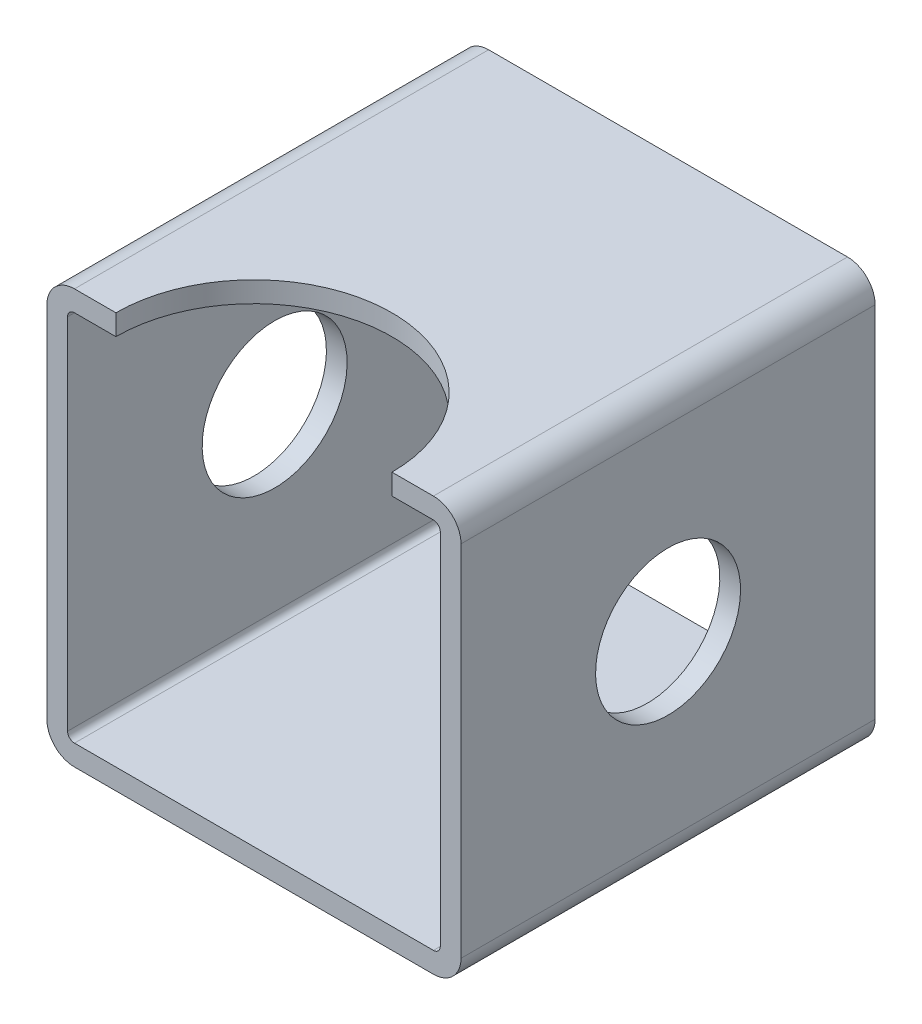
ISO-10303-21;
HEADER;
FILE_DESCRIPTION(('STEP AP214'),'2;1');
FILE_NAME('part.step','',(''),(''),'','','');
FILE_SCHEMA(('AUTOMOTIVE_DESIGN { 1 0 10303 214 1 1 1 1 }'));
ENDSEC;
DATA;
#1=APPLICATION_CONTEXT('core data for automotive mechanical design processes');
#2=APPLICATION_PROTOCOL_DEFINITION('international standard','automotive_design',2000,#1);
#3=PRODUCT_CONTEXT('',#1,'mechanical');
#4=PRODUCT('Part','Part','',(#3));
#5=PRODUCT_RELATED_PRODUCT_CATEGORY('part','',(#4));
#6=PRODUCT_DEFINITION_FORMATION('','',#4);
#7=PRODUCT_DEFINITION_CONTEXT('part definition',#1,'design');
#8=PRODUCT_DEFINITION('design','',#6,#7);
#9=PRODUCT_DEFINITION_SHAPE('','',#8);
#10=(LENGTH_UNIT() NAMED_UNIT(*) SI_UNIT(.MILLI.,.METRE.));
#11=(NAMED_UNIT(*) PLANE_ANGLE_UNIT() SI_UNIT($,.RADIAN.));
#12=(NAMED_UNIT(*) SI_UNIT($,.STERADIAN.) SOLID_ANGLE_UNIT());
#13=UNCERTAINTY_MEASURE_WITH_UNIT(LENGTH_MEASURE(1.E-05),#10,'distance_accuracy_value','');
#14=(GEOMETRIC_REPRESENTATION_CONTEXT(3) GLOBAL_UNCERTAINTY_ASSIGNED_CONTEXT((#13)) GLOBAL_UNIT_ASSIGNED_CONTEXT((#10,
#11,#12)) REPRESENTATION_CONTEXT('',''));
#15=CARTESIAN_POINT('',(0.,0.,0.));
#16=DIRECTION('',(0.,0.,1.));
#17=DIRECTION('',(1.,0.,0.));
#18=AXIS2_PLACEMENT_3D('',#15,#16,#17);
#19=CARTESIAN_POINT('',(56.,-56.,60.));
#20=DIRECTION('',(0.,0.,1.));
#21=DIRECTION('',(1.,0.,0.));
#22=AXIS2_PLACEMENT_3D('',#19,#20,#21);
#23=PLANE('',#22);
#24=DIRECTION('',(0.,1.,0.));
#25=VECTOR('',#24,1.);
#26=CARTESIAN_POINT('',(50.,-5.,60.));
#27=LINE('',#26,#25);
#28=CARTESIAN_POINT('',(50.,-3.,60.));
#29=VERTEX_POINT('',#28);
#30=CARTESIAN_POINT('',(50.,0.,60.));
#31=VERTEX_POINT('',#30);
#32=EDGE_CURVE('E153',#29,#31,#27,.T.);
#33=ORIENTED_EDGE('',*,*,#32,.F.);
#34=DIRECTION('',(-1.,0.,0.));
#35=VECTOR('',#34,1.);
#36=CARTESIAN_POINT('',(4.00000000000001,-3.,60.));
#37=LINE('',#36,#35);
#38=CARTESIAN_POINT('',(56.,-3.,60.));
#39=VERTEX_POINT('',#38);
#40=EDGE_CURVE('E306',#39,#29,#37,.T.);
#41=ORIENTED_EDGE('',*,*,#40,.F.);
#42=CARTESIAN_POINT('',(56.,-4.,60.));
#43=DIRECTION('',(0.,0.,1.));
#44=DIRECTION('',(-1.,0.,0.));
#45=AXIS2_PLACEMENT_3D('',#42,#43,#44);
#46=CIRCLE('',#45,1.);
#47=CARTESIAN_POINT('',(57.,-4.00000000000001,60.));
#48=VERTEX_POINT('',#47);
#49=EDGE_CURVE('E304',#48,#39,#46,.T.);
#50=ORIENTED_EDGE('',*,*,#49,.F.);
#51=DIRECTION('',(0.,1.,0.));
#52=VECTOR('',#51,1.);
#53=CARTESIAN_POINT('',(57.,-4.00000000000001,60.));
#54=LINE('',#53,#52);
#55=CARTESIAN_POINT('',(57.,-56.,60.));
#56=VERTEX_POINT('',#55);
#57=EDGE_CURVE('E302',#56,#48,#54,.T.);
#58=ORIENTED_EDGE('',*,*,#57,.F.);
#59=CARTESIAN_POINT('',(56.,-56.,60.));
#60=DIRECTION('',(0.,0.,1.));
#61=DIRECTION('',(1.,0.,0.));
#62=AXIS2_PLACEMENT_3D('',#59,#60,#61);
#63=CIRCLE('',#62,0.999999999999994);
#64=CARTESIAN_POINT('',(56.,-57.,60.));
#65=VERTEX_POINT('',#64);
#66=EDGE_CURVE('E300',#65,#56,#63,.T.);
#67=ORIENTED_EDGE('',*,*,#66,.F.);
#68=DIRECTION('',(1.,0.,0.));
#69=VECTOR('',#68,1.);
#70=CARTESIAN_POINT('',(4.00000000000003,-57.,60.));
#71=LINE('',#70,#69);
#72=CARTESIAN_POINT('',(4.00000000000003,-57.,60.));
#73=VERTEX_POINT('',#72);
#74=EDGE_CURVE('E298',#73,#65,#71,.T.);
#75=ORIENTED_EDGE('',*,*,#74,.F.);
#76=CARTESIAN_POINT('',(4.00000000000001,-56.,60.));
#77=DIRECTION('',(0.,0.,1.));
#78=DIRECTION('',(-1.,0.,0.));
#79=AXIS2_PLACEMENT_3D('',#76,#77,#78);
#80=CIRCLE('',#79,1.);
#81=CARTESIAN_POINT('',(3.,-56.,60.));
#82=VERTEX_POINT('',#81);
#83=EDGE_CURVE('E296',#82,#73,#80,.T.);
#84=ORIENTED_EDGE('',*,*,#83,.F.);
#85=DIRECTION('',(0.,-1.,0.));
#86=VECTOR('',#85,1.);
#87=CARTESIAN_POINT('',(3.,-4.00000000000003,60.));
#88=LINE('',#87,#86);
#89=CARTESIAN_POINT('',(3.,-4.00000000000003,60.));
#90=VERTEX_POINT('',#89);
#91=EDGE_CURVE('E294',#90,#82,#88,.T.);
#92=ORIENTED_EDGE('',*,*,#91,.F.);
#93=CARTESIAN_POINT('',(4.,-4.,60.));
#94=DIRECTION('',(0.,0.,1.));
#95=DIRECTION('',(1.,0.,0.));
#96=AXIS2_PLACEMENT_3D('',#93,#94,#95);
#97=CIRCLE('',#96,0.999999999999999);
#98=CARTESIAN_POINT('',(4.00000000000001,-3.,60.));
#99=VERTEX_POINT('',#98);
#100=EDGE_CURVE('E292',#99,#90,#97,.T.);
#101=ORIENTED_EDGE('',*,*,#100,.F.);
#102=CARTESIAN_POINT('',(9.99999999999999,-3.,60.));
#103=VERTEX_POINT('',#102);
#104=EDGE_CURVE('E265',#103,#99,#37,.T.);
#105=ORIENTED_EDGE('',*,*,#104,.F.);
#106=DIRECTION('',(0.,1.,0.));
#107=VECTOR('',#106,1.);
#108=CARTESIAN_POINT('',(9.99999999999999,-5.,60.));
#109=LINE('',#108,#107);
#110=CARTESIAN_POINT('',(9.99999999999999,0.,60.));
#111=VERTEX_POINT('',#110);
#112=EDGE_CURVE('E44',#111,#103,#109,.F.);
#113=ORIENTED_EDGE('',*,*,#112,.F.);
#114=DIRECTION('',(-1.,0.,0.));
#115=VECTOR('',#114,1.);
#116=CARTESIAN_POINT('',(4.00000000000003,0.,60.));
#117=LINE('',#116,#115);
#118=CARTESIAN_POINT('',(4.00000000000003,0.,60.));
#119=VERTEX_POINT('',#118);
#120=EDGE_CURVE('E169',#111,#119,#117,.T.);
#121=ORIENTED_EDGE('',*,*,#120,.T.);
#122=CARTESIAN_POINT('',(4.,-4.,60.));
#123=DIRECTION('',(0.,0.,1.));
#124=DIRECTION('',(1.,0.,0.));
#125=AXIS2_PLACEMENT_3D('',#122,#123,#124);
#126=CIRCLE('',#125,4.);
#127=CARTESIAN_POINT('',(0.,-4.00000000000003,60.));
#128=VERTEX_POINT('',#127);
#129=EDGE_CURVE('E175',#119,#128,#126,.T.);
#130=ORIENTED_EDGE('',*,*,#129,.T.);
#131=DIRECTION('',(0.,-1.,0.));
#132=VECTOR('',#131,1.);
#133=CARTESIAN_POINT('',(0.,-4.00000000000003,60.));
#134=LINE('',#133,#132);
#135=CARTESIAN_POINT('',(0.,-56.,60.));
#136=VERTEX_POINT('',#135);
#137=EDGE_CURVE('E177',#128,#136,#134,.T.);
#138=ORIENTED_EDGE('',*,*,#137,.T.);
#139=CARTESIAN_POINT('',(4.00000000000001,-56.,60.));
#140=DIRECTION('',(0.,0.,1.));
#141=DIRECTION('',(-1.,0.,0.));
#142=AXIS2_PLACEMENT_3D('',#139,#140,#141);
#143=CIRCLE('',#142,4.);
#144=CARTESIAN_POINT('',(4.00000000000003,-60.,60.));
#145=VERTEX_POINT('',#144);
#146=EDGE_CURVE('E183',#136,#145,#143,.T.);
#147=ORIENTED_EDGE('',*,*,#146,.T.);
#148=DIRECTION('',(1.,0.,0.));
#149=VECTOR('',#148,1.);
#150=CARTESIAN_POINT('',(4.00000000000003,-60.,60.));
#151=LINE('',#150,#149);
#152=CARTESIAN_POINT('',(56.,-60.,60.));
#153=VERTEX_POINT('',#152);
#154=EDGE_CURVE('E185',#145,#153,#151,.T.);
#155=ORIENTED_EDGE('',*,*,#154,.T.);
#156=CARTESIAN_POINT('',(56.,-56.,60.));
#157=DIRECTION('',(0.,0.,1.));
#158=DIRECTION('',(1.,0.,0.));
#159=AXIS2_PLACEMENT_3D('',#156,#157,#158);
#160=CIRCLE('',#159,4.);
#161=CARTESIAN_POINT('',(60.,-56.,60.));
#162=VERTEX_POINT('',#161);
#163=EDGE_CURVE('E243',#153,#162,#160,.T.);
#164=ORIENTED_EDGE('',*,*,#163,.T.);
#165=DIRECTION('',(0.,1.,0.));
#166=VECTOR('',#165,1.);
#167=CARTESIAN_POINT('',(60.,-4.00000000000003,60.));
#168=LINE('',#167,#166);
#169=CARTESIAN_POINT('',(60.,-4.00000000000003,60.));
#170=VERTEX_POINT('',#169);
#171=EDGE_CURVE('E214',#162,#170,#168,.T.);
#172=ORIENTED_EDGE('',*,*,#171,.T.);
#173=CARTESIAN_POINT('',(56.,-4.,60.));
#174=DIRECTION('',(0.,0.,1.));
#175=DIRECTION('',(-1.,0.,0.));
#176=AXIS2_PLACEMENT_3D('',#173,#174,#175);
#177=CIRCLE('',#176,4.);
#178=CARTESIAN_POINT('',(56.,0.,60.));
#179=VERTEX_POINT('',#178);
#180=EDGE_CURVE('E173',#170,#179,#177,.T.);
#181=ORIENTED_EDGE('',*,*,#180,.T.);
#182=EDGE_CURVE('E167',#179,#31,#117,.T.);
#183=ORIENTED_EDGE('',*,*,#182,.T.);
#184=EDGE_LOOP('',(#33,#41,#50,#58,#67,#75,#84,#92,#101,#105,#113,#121,#130,#138,#147,#155,#164,
#172,#181,#183));
#185=FACE_BOUND('',#184,.T.);
#186=ADVANCED_FACE('F29',(#185),#23,.T.);
#187=CARTESIAN_POINT('',(56.,-56.,0.));
#188=DIRECTION('',(0.,0.,1.));
#189=DIRECTION('',(1.,0.,0.));
#190=AXIS2_PLACEMENT_3D('',#187,#188,#189);
#191=PLANE('',#190);
#192=CARTESIAN_POINT('',(56.,-56.,0.));
#193=DIRECTION('',(0.,0.,1.));
#194=DIRECTION('',(1.,0.,0.));
#195=AXIS2_PLACEMENT_3D('',#192,#193,#194);
#196=CIRCLE('',#195,4.);
#197=CARTESIAN_POINT('',(56.,-60.,0.));
#198=VERTEX_POINT('',#197);
#199=CARTESIAN_POINT('',(60.,-56.,0.));
#200=VERTEX_POINT('',#199);
#201=EDGE_CURVE('E219',#198,#200,#196,.T.);
#202=ORIENTED_EDGE('',*,*,#201,.F.);
#203=DIRECTION('',(1.,0.,0.));
#204=VECTOR('',#203,1.);
#205=CARTESIAN_POINT('',(4.00000000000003,-60.,0.));
#206=LINE('',#205,#204);
#207=CARTESIAN_POINT('',(4.00000000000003,-60.,0.));
#208=VERTEX_POINT('',#207);
#209=EDGE_CURVE('E241',#208,#198,#206,.T.);
#210=ORIENTED_EDGE('',*,*,#209,.F.);
#211=CARTESIAN_POINT('',(4.00000000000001,-56.,0.));
#212=DIRECTION('',(0.,0.,1.));
#213=DIRECTION('',(-1.,0.,0.));
#214=AXIS2_PLACEMENT_3D('',#211,#212,#213);
#215=CIRCLE('',#214,4.);
#216=CARTESIAN_POINT('',(0.,-56.,0.));
#217=VERTEX_POINT('',#216);
#218=EDGE_CURVE('E239',#217,#208,#215,.T.);
#219=ORIENTED_EDGE('',*,*,#218,.F.);
#220=DIRECTION('',(0.,-1.,0.));
#221=VECTOR('',#220,1.);
#222=CARTESIAN_POINT('',(0.,-4.00000000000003,0.));
#223=LINE('',#222,#221);
#224=CARTESIAN_POINT('',(0.,-4.00000000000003,0.));
#225=VERTEX_POINT('',#224);
#226=EDGE_CURVE('E237',#225,#217,#223,.T.);
#227=ORIENTED_EDGE('',*,*,#226,.F.);
#228=CARTESIAN_POINT('',(4.,-4.,0.));
#229=DIRECTION('',(0.,0.,1.));
#230=DIRECTION('',(1.,0.,0.));
#231=AXIS2_PLACEMENT_3D('',#228,#229,#230);
#232=CIRCLE('',#231,4.);
#233=CARTESIAN_POINT('',(4.00000000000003,0.,0.));
#234=VERTEX_POINT('',#233);
#235=EDGE_CURVE('E235',#234,#225,#232,.T.);
#236=ORIENTED_EDGE('',*,*,#235,.F.);
#237=DIRECTION('',(-1.,0.,0.));
#238=VECTOR('',#237,1.);
#239=CARTESIAN_POINT('',(4.00000000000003,0.,0.));
#240=LINE('',#239,#238);
#241=CARTESIAN_POINT('',(56.,0.,0.));
#242=VERTEX_POINT('',#241);
#243=EDGE_CURVE('E233',#242,#234,#240,.T.);
#244=ORIENTED_EDGE('',*,*,#243,.F.);
#245=CARTESIAN_POINT('',(56.,-4.,0.));
#246=DIRECTION('',(0.,0.,1.));
#247=DIRECTION('',(-1.,0.,0.));
#248=AXIS2_PLACEMENT_3D('',#245,#246,#247);
#249=CIRCLE('',#248,4.);
#250=CARTESIAN_POINT('',(60.,-4.00000000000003,0.));
#251=VERTEX_POINT('',#250);
#252=EDGE_CURVE('E225',#251,#242,#249,.T.);
#253=ORIENTED_EDGE('',*,*,#252,.F.);
#254=DIRECTION('',(0.,1.,0.));
#255=VECTOR('',#254,1.);
#256=CARTESIAN_POINT('',(60.,-4.00000000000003,0.));
#257=LINE('',#256,#255);
#258=EDGE_CURVE('E213',#200,#251,#257,.T.);
#259=ORIENTED_EDGE('',*,*,#258,.F.);
#260=EDGE_LOOP('',(#202,#210,#219,#227,#236,#244,#253,#259));
#261=FACE_BOUND('',#260,.T.);
#262=CARTESIAN_POINT('',(4.,-4.,0.));
#263=DIRECTION('',(0.,0.,1.));
#264=DIRECTION('',(1.,0.,0.));
#265=AXIS2_PLACEMENT_3D('',#262,#263,#264);
#266=CIRCLE('',#265,0.999999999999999);
#267=CARTESIAN_POINT('',(4.00000000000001,-3.,0.));
#268=VERTEX_POINT('',#267);
#269=CARTESIAN_POINT('',(3.,-4.00000000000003,0.));
#270=VERTEX_POINT('',#269);
#271=EDGE_CURVE('E160',#268,#270,#266,.T.);
#272=ORIENTED_EDGE('',*,*,#271,.T.);
#273=DIRECTION('',(0.,-1.,0.));
#274=VECTOR('',#273,1.);
#275=CARTESIAN_POINT('',(3.,-4.00000000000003,0.));
#276=LINE('',#275,#274);
#277=CARTESIAN_POINT('',(3.,-56.,0.));
#278=VERTEX_POINT('',#277);
#279=EDGE_CURVE('E271',#270,#278,#276,.T.);
#280=ORIENTED_EDGE('',*,*,#279,.T.);
#281=CARTESIAN_POINT('',(4.00000000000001,-56.,0.));
#282=DIRECTION('',(0.,0.,1.));
#283=DIRECTION('',(-1.,0.,0.));
#284=AXIS2_PLACEMENT_3D('',#281,#282,#283);
#285=CIRCLE('',#284,1.);
#286=CARTESIAN_POINT('',(4.00000000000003,-57.,0.));
#287=VERTEX_POINT('',#286);
#288=EDGE_CURVE('E274',#278,#287,#285,.T.);
#289=ORIENTED_EDGE('',*,*,#288,.T.);
#290=DIRECTION('',(1.,0.,0.));
#291=VECTOR('',#290,1.);
#292=CARTESIAN_POINT('',(4.00000000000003,-57.,0.));
#293=LINE('',#292,#291);
#294=CARTESIAN_POINT('',(56.,-57.,0.));
#295=VERTEX_POINT('',#294);
#296=EDGE_CURVE('E277',#287,#295,#293,.T.);
#297=ORIENTED_EDGE('',*,*,#296,.T.);
#298=CARTESIAN_POINT('',(56.,-56.,0.));
#299=DIRECTION('',(0.,0.,1.));
#300=DIRECTION('',(1.,0.,0.));
#301=AXIS2_PLACEMENT_3D('',#298,#299,#300);
#302=CIRCLE('',#301,0.999999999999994);
#303=CARTESIAN_POINT('',(57.,-56.,0.));
#304=VERTEX_POINT('',#303);
#305=EDGE_CURVE('E280',#295,#304,#302,.T.);
#306=ORIENTED_EDGE('',*,*,#305,.T.);
#307=DIRECTION('',(0.,1.,0.));
#308=VECTOR('',#307,1.);
#309=CARTESIAN_POINT('',(57.,-4.00000000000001,0.));
#310=LINE('',#309,#308);
#311=CARTESIAN_POINT('',(57.,-4.00000000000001,0.));
#312=VERTEX_POINT('',#311);
#313=EDGE_CURVE('E283',#304,#312,#310,.T.);
#314=ORIENTED_EDGE('',*,*,#313,.T.);
#315=CARTESIAN_POINT('',(56.,-4.,0.));
#316=DIRECTION('',(0.,0.,1.));
#317=DIRECTION('',(-1.,0.,0.));
#318=AXIS2_PLACEMENT_3D('',#315,#316,#317);
#319=CIRCLE('',#318,1.);
#320=CARTESIAN_POINT('',(56.,-3.,0.));
#321=VERTEX_POINT('',#320);
#322=EDGE_CURVE('E286',#312,#321,#319,.T.);
#323=ORIENTED_EDGE('',*,*,#322,.T.);
#324=DIRECTION('',(-1.,0.,0.));
#325=VECTOR('',#324,1.);
#326=CARTESIAN_POINT('',(4.00000000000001,-3.,0.));
#327=LINE('',#326,#325);
#328=EDGE_CURVE('E289',#321,#268,#327,.T.);
#329=ORIENTED_EDGE('',*,*,#328,.T.);
#330=EDGE_LOOP('',(#272,#280,#289,#297,#306,#314,#323,#329));
#331=FACE_BOUND('',#330,.T.);
#332=ADVANCED_FACE('F249',(#261,#331),#191,.F.);
#333=CARTESIAN_POINT('',(56.,-56.,60.));
#334=DIRECTION('',(0.,0.,-1.));
#335=DIRECTION('',(-1.,0.,0.));
#336=AXIS2_PLACEMENT_3D('',#333,#334,#335);
#337=CYLINDRICAL_SURFACE('',#336,4.);
#338=ORIENTED_EDGE('',*,*,#201,.T.);
#339=DIRECTION('',(0.,0.,-1.));
#340=VECTOR('',#339,1.);
#341=CARTESIAN_POINT('',(60.,-56.,60.));
#342=LINE('',#341,#340);
#343=EDGE_CURVE('E38',#162,#200,#342,.T.);
#344=ORIENTED_EDGE('',*,*,#343,.F.);
#345=ORIENTED_EDGE('',*,*,#163,.F.);
#346=DIRECTION('',(0.,0.,-1.));
#347=VECTOR('',#346,1.);
#348=CARTESIAN_POINT('',(56.,-60.,60.));
#349=LINE('',#348,#347);
#350=EDGE_CURVE('E187',#153,#198,#349,.T.);
#351=ORIENTED_EDGE('',*,*,#350,.T.);
#352=EDGE_LOOP('',(#338,#344,#345,#351));
#353=FACE_BOUND('',#352,.T.);
#354=ADVANCED_FACE('F31',(#353),#337,.T.);
#355=CARTESIAN_POINT('',(60.,-4.00000000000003,60.));
#356=DIRECTION('',(-1.,0.,0.));
#357=DIRECTION('',(0.,-1.,0.));
#358=AXIS2_PLACEMENT_3D('',#355,#356,#357);
#359=PLANE('',#358);
#360=CARTESIAN_POINT('',(60.,-30.,30.));
#361=DIRECTION('',(1.,0.,0.));
#362=DIRECTION('',(0.,1.,0.));
#363=AXIS2_PLACEMENT_3D('',#360,#361,#362);
#364=CIRCLE('',#363,10.5);
#365=CARTESIAN_POINT('',(60.,-19.5,30.));
#366=VERTEX_POINT('',#365);
#367=EDGE_CURVE('E391',#366,#366,#364,.T.);
#368=ORIENTED_EDGE('',*,*,#367,.F.);
#369=EDGE_LOOP('',(#368));
#370=FACE_BOUND('',#369,.T.);
#371=ORIENTED_EDGE('',*,*,#258,.T.);
#372=DIRECTION('',(0.,0.,-1.));
#373=VECTOR('',#372,1.);
#374=CARTESIAN_POINT('',(60.,-4.00000000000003,60.));
#375=LINE('',#374,#373);
#376=EDGE_CURVE('E204',#170,#251,#375,.T.);
#377=ORIENTED_EDGE('',*,*,#376,.F.);
#378=ORIENTED_EDGE('',*,*,#171,.F.);
#379=ORIENTED_EDGE('',*,*,#343,.T.);
#380=EDGE_LOOP('',(#371,#377,#378,#379));
#381=FACE_BOUND('',#380,.T.);
#382=ADVANCED_FACE('F211',(#370,#381),#359,.F.);
#383=CARTESIAN_POINT('',(56.,-4.,60.));
#384=DIRECTION('',(0.,0.,-1.));
#385=DIRECTION('',(-1.,0.,0.));
#386=AXIS2_PLACEMENT_3D('',#383,#384,#385);
#387=CYLINDRICAL_SURFACE('',#386,4.);
#388=ORIENTED_EDGE('',*,*,#252,.T.);
#389=DIRECTION('',(0.,0.,-1.));
#390=VECTOR('',#389,1.);
#391=CARTESIAN_POINT('',(56.,0.,60.));
#392=LINE('',#391,#390);
#393=EDGE_CURVE('E202',#179,#242,#392,.T.);
#394=ORIENTED_EDGE('',*,*,#393,.F.);
#395=ORIENTED_EDGE('',*,*,#180,.F.);
#396=ORIENTED_EDGE('',*,*,#376,.T.);
#397=EDGE_LOOP('',(#388,#394,#395,#396));
#398=FACE_BOUND('',#397,.T.);
#399=ADVANCED_FACE('F246',(#398),#387,.T.);
#400=CARTESIAN_POINT('',(4.00000000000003,0.,60.));
#401=DIRECTION('',(0.,-1.,0.));
#402=DIRECTION('',(0.,0.,-1.));
#403=AXIS2_PLACEMENT_3D('',#400,#401,#402);
#404=PLANE('',#403);
#405=ORIENTED_EDGE('',*,*,#120,.F.);
#406=CARTESIAN_POINT('',(30.,0.,60.));
#407=DIRECTION('',(0.,1.,0.));
#408=DIRECTION('',(0.,0.,1.));
#409=AXIS2_PLACEMENT_3D('',#406,#407,#408);
#410=CIRCLE('',#409,20.);
#411=EDGE_CURVE('E156',#31,#111,#410,.T.);
#412=ORIENTED_EDGE('',*,*,#411,.F.);
#413=ORIENTED_EDGE('',*,*,#182,.F.);
#414=ORIENTED_EDGE('',*,*,#393,.T.);
#415=ORIENTED_EDGE('',*,*,#243,.T.);
#416=DIRECTION('',(0.,0.,-1.));
#417=VECTOR('',#416,1.);
#418=CARTESIAN_POINT('',(4.00000000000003,0.,60.));
#419=LINE('',#418,#417);
#420=EDGE_CURVE('E199',#119,#234,#419,.T.);
#421=ORIENTED_EDGE('',*,*,#420,.F.);
#422=EDGE_LOOP('',(#405,#412,#413,#414,#415,#421));
#423=FACE_BOUND('',#422,.T.);
#424=ADVANCED_FACE('F165',(#423),#404,.F.);
#425=CARTESIAN_POINT('',(4.,-4.,60.));
#426=DIRECTION('',(0.,0.,-1.));
#427=DIRECTION('',(-1.,0.,0.));
#428=AXIS2_PLACEMENT_3D('',#425,#426,#427);
#429=CYLINDRICAL_SURFACE('',#428,4.);
#430=ORIENTED_EDGE('',*,*,#235,.T.);
#431=DIRECTION('',(0.,0.,-1.));
#432=VECTOR('',#431,1.);
#433=CARTESIAN_POINT('',(0.,-4.00000000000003,60.));
#434=LINE('',#433,#432);
#435=EDGE_CURVE('E196',#128,#225,#434,.T.);
#436=ORIENTED_EDGE('',*,*,#435,.F.);
#437=ORIENTED_EDGE('',*,*,#129,.F.);
#438=ORIENTED_EDGE('',*,*,#420,.T.);
#439=EDGE_LOOP('',(#430,#436,#437,#438));
#440=FACE_BOUND('',#439,.T.);
#441=ADVANCED_FACE('F255',(#440),#429,.T.);
#442=CARTESIAN_POINT('',(0.,-4.00000000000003,60.));
#443=DIRECTION('',(1.,0.,0.));
#444=DIRECTION('',(0.,1.,0.));
#445=AXIS2_PLACEMENT_3D('',#442,#443,#444);
#446=PLANE('',#445);
#447=CARTESIAN_POINT('',(0.,-30.,30.));
#448=DIRECTION('',(1.,0.,0.));
#449=DIRECTION('',(0.,1.,0.));
#450=AXIS2_PLACEMENT_3D('',#447,#448,#449);
#451=CIRCLE('',#450,10.5);
#452=CARTESIAN_POINT('',(0.,-19.5,30.));
#453=VERTEX_POINT('',#452);
#454=EDGE_CURVE('E393',#453,#453,#451,.T.);
#455=ORIENTED_EDGE('',*,*,#454,.T.);
#456=EDGE_LOOP('',(#455));
#457=FACE_BOUND('',#456,.T.);
#458=ORIENTED_EDGE('',*,*,#226,.T.);
#459=DIRECTION('',(0.,0.,-1.));
#460=VECTOR('',#459,1.);
#461=CARTESIAN_POINT('',(0.,-56.,60.));
#462=LINE('',#461,#460);
#463=EDGE_CURVE('E193',#136,#217,#462,.T.);
#464=ORIENTED_EDGE('',*,*,#463,.F.);
#465=ORIENTED_EDGE('',*,*,#137,.F.);
#466=ORIENTED_EDGE('',*,*,#435,.T.);
#467=EDGE_LOOP('',(#458,#464,#465,#466));
#468=FACE_BOUND('',#467,.T.);
#469=ADVANCED_FACE('F259',(#457,#468),#446,.F.);
#470=CARTESIAN_POINT('',(4.00000000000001,-56.,60.));
#471=DIRECTION('',(0.,0.,-1.));
#472=DIRECTION('',(-1.,0.,0.));
#473=AXIS2_PLACEMENT_3D('',#470,#471,#472);
#474=CYLINDRICAL_SURFACE('',#473,4.);
#475=ORIENTED_EDGE('',*,*,#218,.T.);
#476=DIRECTION('',(0.,0.,-1.));
#477=VECTOR('',#476,1.);
#478=CARTESIAN_POINT('',(4.00000000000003,-60.,60.));
#479=LINE('',#478,#477);
#480=EDGE_CURVE('E190',#145,#208,#479,.T.);
#481=ORIENTED_EDGE('',*,*,#480,.F.);
#482=ORIENTED_EDGE('',*,*,#146,.F.);
#483=ORIENTED_EDGE('',*,*,#463,.T.);
#484=EDGE_LOOP('',(#475,#481,#482,#483));
#485=FACE_BOUND('',#484,.T.);
#486=ADVANCED_FACE('F371',(#485),#474,.T.);
#487=CARTESIAN_POINT('',(4.00000000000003,-60.,60.));
#488=DIRECTION('',(0.,1.,0.));
#489=DIRECTION('',(0.,0.,1.));
#490=AXIS2_PLACEMENT_3D('',#487,#488,#489);
#491=PLANE('',#490);
#492=ORIENTED_EDGE('',*,*,#209,.T.);
#493=ORIENTED_EDGE('',*,*,#350,.F.);
#494=ORIENTED_EDGE('',*,*,#154,.F.);
#495=ORIENTED_EDGE('',*,*,#480,.T.);
#496=EDGE_LOOP('',(#492,#493,#494,#495));
#497=FACE_BOUND('',#496,.T.);
#498=ADVANCED_FACE('F368',(#497),#491,.F.);
#499=CARTESIAN_POINT('',(4.,-4.,60.));
#500=DIRECTION('',(0.,0.,-1.));
#501=DIRECTION('',(-1.,0.,0.));
#502=AXIS2_PLACEMENT_3D('',#499,#500,#501);
#503=CYLINDRICAL_SURFACE('',#502,0.999999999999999);
#504=ORIENTED_EDGE('',*,*,#271,.F.);
#505=DIRECTION('',(0.,0.,-1.));
#506=VECTOR('',#505,1.);
#507=CARTESIAN_POINT('',(4.00000000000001,-3.,60.));
#508=LINE('',#507,#506);
#509=EDGE_CURVE('E308',#99,#268,#508,.T.);
#510=ORIENTED_EDGE('',*,*,#509,.F.);
#511=ORIENTED_EDGE('',*,*,#100,.T.);
#512=DIRECTION('',(0.,0.,-1.));
#513=VECTOR('',#512,1.);
#514=CARTESIAN_POINT('',(3.,-4.00000000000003,60.));
#515=LINE('',#514,#513);
#516=EDGE_CURVE('E223',#90,#270,#515,.T.);
#517=ORIENTED_EDGE('',*,*,#516,.T.);
#518=EDGE_LOOP('',(#504,#510,#511,#517));
#519=FACE_BOUND('',#518,.T.);
#520=ADVANCED_FACE('F332',(#519),#503,.F.);
#521=CARTESIAN_POINT('',(3.,-4.00000000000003,60.));
#522=DIRECTION('',(1.,0.,0.));
#523=DIRECTION('',(0.,1.,0.));
#524=AXIS2_PLACEMENT_3D('',#521,#522,#523);
#525=PLANE('',#524);
#526=CARTESIAN_POINT('',(3.,-30.,30.));
#527=DIRECTION('',(1.,0.,0.));
#528=DIRECTION('',(0.,1.,0.));
#529=AXIS2_PLACEMENT_3D('',#526,#527,#528);
#530=CIRCLE('',#529,10.5);
#531=CARTESIAN_POINT('',(3.,-19.5,30.));
#532=VERTEX_POINT('',#531);
#533=EDGE_CURVE('E170',#532,#532,#530,.T.);
#534=ORIENTED_EDGE('',*,*,#533,.F.);
#535=EDGE_LOOP('',(#534));
#536=FACE_BOUND('',#535,.T.);
#537=ORIENTED_EDGE('',*,*,#279,.F.);
#538=ORIENTED_EDGE('',*,*,#516,.F.);
#539=ORIENTED_EDGE('',*,*,#91,.T.);
#540=DIRECTION('',(0.,0.,-1.));
#541=VECTOR('',#540,1.);
#542=CARTESIAN_POINT('',(3.,-56.,60.));
#543=LINE('',#542,#541);
#544=EDGE_CURVE('E228',#82,#278,#543,.T.);
#545=ORIENTED_EDGE('',*,*,#544,.T.);
#546=EDGE_LOOP('',(#537,#538,#539,#545));
#547=FACE_BOUND('',#546,.T.);
#548=ADVANCED_FACE('F322',(#536,#547),#525,.T.);
#549=CARTESIAN_POINT('',(4.00000000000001,-56.,60.));
#550=DIRECTION('',(0.,0.,-1.));
#551=DIRECTION('',(-1.,0.,0.));
#552=AXIS2_PLACEMENT_3D('',#549,#550,#551);
#553=CYLINDRICAL_SURFACE('',#552,1.);
#554=ORIENTED_EDGE('',*,*,#288,.F.);
#555=ORIENTED_EDGE('',*,*,#544,.F.);
#556=ORIENTED_EDGE('',*,*,#83,.T.);
#557=DIRECTION('',(0.,0.,-1.));
#558=VECTOR('',#557,1.);
#559=CARTESIAN_POINT('',(4.00000000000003,-57.,60.));
#560=LINE('',#559,#558);
#561=EDGE_CURVE('E318',#73,#287,#560,.T.);
#562=ORIENTED_EDGE('',*,*,#561,.T.);
#563=EDGE_LOOP('',(#554,#555,#556,#562));
#564=FACE_BOUND('',#563,.T.);
#565=ADVANCED_FACE('F327',(#564),#553,.F.);
#566=CARTESIAN_POINT('',(4.00000000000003,-57.,60.));
#567=DIRECTION('',(0.,1.,0.));
#568=DIRECTION('',(0.,0.,1.));
#569=AXIS2_PLACEMENT_3D('',#566,#567,#568);
#570=PLANE('',#569);
#571=ORIENTED_EDGE('',*,*,#296,.F.);
#572=ORIENTED_EDGE('',*,*,#561,.F.);
#573=ORIENTED_EDGE('',*,*,#74,.T.);
#574=DIRECTION('',(0.,0.,-1.));
#575=VECTOR('',#574,1.);
#576=CARTESIAN_POINT('',(56.,-57.,60.));
#577=LINE('',#576,#575);
#578=EDGE_CURVE('E316',#65,#295,#577,.T.);
#579=ORIENTED_EDGE('',*,*,#578,.T.);
#580=EDGE_LOOP('',(#571,#572,#573,#579));
#581=FACE_BOUND('',#580,.T.);
#582=ADVANCED_FACE('F351',(#581),#570,.T.);
#583=CARTESIAN_POINT('',(56.,-56.,60.));
#584=DIRECTION('',(0.,0.,-1.));
#585=DIRECTION('',(-1.,0.,0.));
#586=AXIS2_PLACEMENT_3D('',#583,#584,#585);
#587=CYLINDRICAL_SURFACE('',#586,0.999999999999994);
#588=ORIENTED_EDGE('',*,*,#305,.F.);
#589=ORIENTED_EDGE('',*,*,#578,.F.);
#590=ORIENTED_EDGE('',*,*,#66,.T.);
#591=DIRECTION('',(0.,0.,-1.));
#592=VECTOR('',#591,1.);
#593=CARTESIAN_POINT('',(57.,-56.,60.));
#594=LINE('',#593,#592);
#595=EDGE_CURVE('E314',#56,#304,#594,.T.);
#596=ORIENTED_EDGE('',*,*,#595,.T.);
#597=EDGE_LOOP('',(#588,#589,#590,#596));
#598=FACE_BOUND('',#597,.T.);
#599=ADVANCED_FACE('F347',(#598),#587,.F.);
#600=CARTESIAN_POINT('',(57.,-4.00000000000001,60.));
#601=DIRECTION('',(-1.,0.,0.));
#602=DIRECTION('',(0.,0.,1.));
#603=AXIS2_PLACEMENT_3D('',#600,#601,#602);
#604=PLANE('',#603);
#605=CARTESIAN_POINT('',(57.,-30.,30.));
#606=DIRECTION('',(-1.,0.,0.));
#607=DIRECTION('',(0.,0.,1.));
#608=AXIS2_PLACEMENT_3D('',#605,#606,#607);
#609=CIRCLE('',#608,10.5);
#610=CARTESIAN_POINT('',(57.,-30.,40.5));
#611=VERTEX_POINT('',#610);
#612=EDGE_CURVE('E33',#611,#611,#609,.T.);
#613=ORIENTED_EDGE('',*,*,#612,.F.);
#614=EDGE_LOOP('',(#613));
#615=FACE_BOUND('',#614,.T.);
#616=ORIENTED_EDGE('',*,*,#313,.F.);
#617=ORIENTED_EDGE('',*,*,#595,.F.);
#618=ORIENTED_EDGE('',*,*,#57,.T.);
#619=DIRECTION('',(0.,0.,-1.));
#620=VECTOR('',#619,1.);
#621=CARTESIAN_POINT('',(57.,-4.00000000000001,60.));
#622=LINE('',#621,#620);
#623=EDGE_CURVE('E312',#48,#312,#622,.T.);
#624=ORIENTED_EDGE('',*,*,#623,.T.);
#625=EDGE_LOOP('',(#616,#617,#618,#624));
#626=FACE_BOUND('',#625,.T.);
#627=ADVANCED_FACE('F343',(#615,#626),#604,.T.);
#628=CARTESIAN_POINT('',(56.,-4.,60.));
#629=DIRECTION('',(0.,0.,-1.));
#630=DIRECTION('',(-1.,0.,0.));
#631=AXIS2_PLACEMENT_3D('',#628,#629,#630);
#632=CYLINDRICAL_SURFACE('',#631,1.);
#633=ORIENTED_EDGE('',*,*,#322,.F.);
#634=ORIENTED_EDGE('',*,*,#623,.F.);
#635=ORIENTED_EDGE('',*,*,#49,.T.);
#636=DIRECTION('',(0.,0.,-1.));
#637=VECTOR('',#636,1.);
#638=CARTESIAN_POINT('',(56.,-3.,60.));
#639=LINE('',#638,#637);
#640=EDGE_CURVE('E52',#39,#321,#639,.T.);
#641=ORIENTED_EDGE('',*,*,#640,.T.);
#642=EDGE_LOOP('',(#633,#634,#635,#641));
#643=FACE_BOUND('',#642,.T.);
#644=ADVANCED_FACE('F340',(#643),#632,.F.);
#645=CARTESIAN_POINT('',(4.00000000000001,-3.,60.));
#646=DIRECTION('',(0.,-1.,0.));
#647=DIRECTION('',(0.,0.,-1.));
#648=AXIS2_PLACEMENT_3D('',#645,#646,#647);
#649=PLANE('',#648);
#650=CARTESIAN_POINT('',(30.,-3.,60.));
#651=DIRECTION('',(0.,-1.,0.));
#652=DIRECTION('',(0.,0.,-1.));
#653=AXIS2_PLACEMENT_3D('',#650,#651,#652);
#654=CIRCLE('',#653,20.);
#655=EDGE_CURVE('E11',#103,#29,#654,.T.);
#656=ORIENTED_EDGE('',*,*,#655,.F.);
#657=ORIENTED_EDGE('',*,*,#104,.T.);
#658=ORIENTED_EDGE('',*,*,#509,.T.);
#659=ORIENTED_EDGE('',*,*,#328,.F.);
#660=ORIENTED_EDGE('',*,*,#640,.F.);
#661=ORIENTED_EDGE('',*,*,#40,.T.);
#662=EDGE_LOOP('',(#656,#657,#658,#659,#660,#661));
#663=FACE_BOUND('',#662,.T.);
#664=ADVANCED_FACE('F333',(#663),#649,.T.);
#665=CARTESIAN_POINT('',(30.,-5.,60.));
#666=DIRECTION('',(0.,1.,0.));
#667=DIRECTION('',(0.,0.,1.));
#668=AXIS2_PLACEMENT_3D('',#665,#666,#667);
#669=CYLINDRICAL_SURFACE('',#668,20.);
#670=ORIENTED_EDGE('',*,*,#32,.T.);
#671=ORIENTED_EDGE('',*,*,#411,.T.);
#672=ORIENTED_EDGE('',*,*,#112,.T.);
#673=ORIENTED_EDGE('',*,*,#655,.T.);
#674=EDGE_LOOP('',(#670,#671,#672,#673));
#675=FACE_BOUND('',#674,.T.);
#676=ADVANCED_FACE('F155',(#675),#669,.F.);
#677=CARTESIAN_POINT('',(0.,-30.,30.));
#678=DIRECTION('',(1.,0.,0.));
#679=DIRECTION('',(0.,1.,0.));
#680=AXIS2_PLACEMENT_3D('',#677,#678,#679);
#681=CYLINDRICAL_SURFACE('',#680,10.5);
#682=ORIENTED_EDGE('',*,*,#612,.T.);
#683=EDGE_LOOP('',(#682));
#684=FACE_BOUND('',#683,.T.);
#685=ORIENTED_EDGE('',*,*,#367,.T.);
#686=EDGE_LOOP('',(#685));
#687=FACE_BOUND('',#686,.T.);
#688=ADVANCED_FACE('F403',(#684,#687),#681,.F.);
#689=ORIENTED_EDGE('',*,*,#533,.T.);
#690=EDGE_LOOP('',(#689));
#691=FACE_BOUND('',#690,.T.);
#692=ORIENTED_EDGE('',*,*,#454,.F.);
#693=EDGE_LOOP('',(#692));
#694=FACE_BOUND('',#693,.T.);
#695=ADVANCED_FACE('F417',(#691,#694),#681,.F.);
#696=CLOSED_SHELL('',(#186,#332,#354,#382,#399,#424,#441,#469,#486,#498,#520,#548,#565,#582,
#599,#627,#644,#664,#676,#688,#695));
#697=MANIFOLD_SOLID_BREP('B2',#696);
#698=ADVANCED_BREP_SHAPE_REPRESENTATION('',(#18,#697),#14);
#699=SHAPE_DEFINITION_REPRESENTATION(#9,#698);
ENDSEC;
END-ISO-10303-21;
